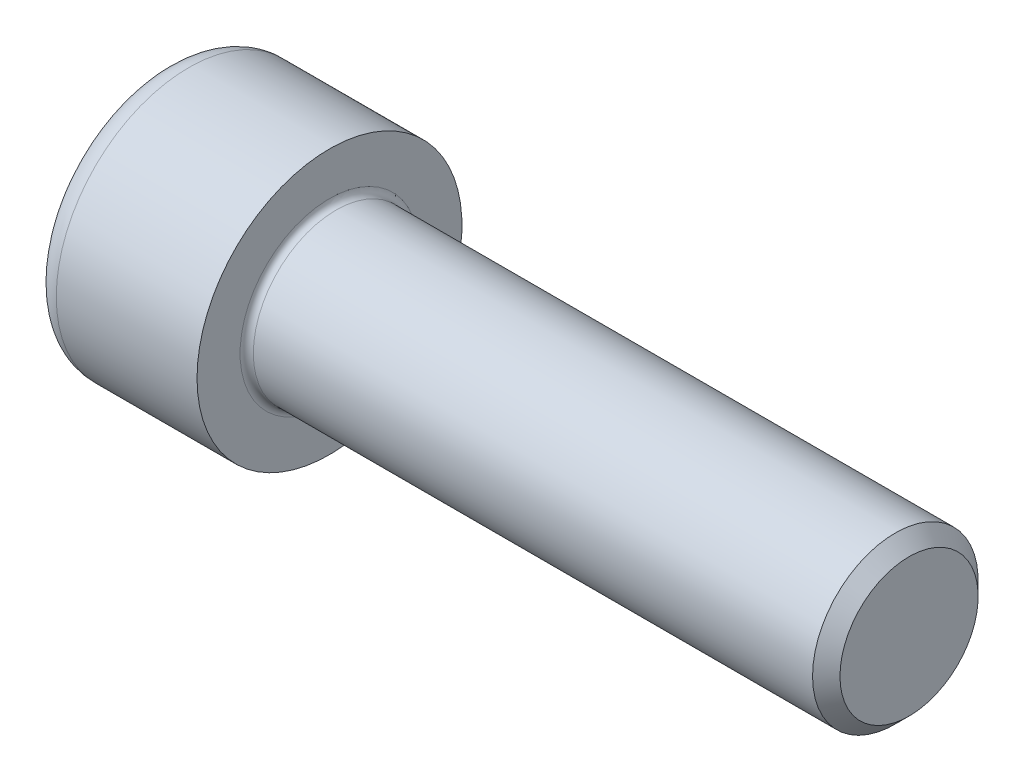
from build123d import *

# Parameters (mm, degrees)
FILLET1_R   = 0.4
FILLET2_R   = 1.5
HEX_2_DEPTH = 5


with BuildPart() as part:
    # BodySke → Base-Revolve (revolve)
    with BuildSketch(Plane.XY, mode=Mode.PRIVATE) as base_revolve_sk:
        Polygon((0, 0), (0, 8), (10, 8), (10, 5), (44.172, 5), (45, 4.172), (45, 0), align=None)
    revolve(base_revolve_sk.sketch.rotate(Axis((-31.75, 0, 0), (1, 0, 0)), 90), axis=Axis((-31.75, 0, 0), (1, 0, 0)))

    # Fillet1
    fillet1_edges = [part.edges().sort_by_distance(p)[0] for p in [
        (10, 0, -5),
    ]]
    fillet(fillet1_edges, radius=FILLET1_R)

    # Fillet2
    fillet2_edges = [part.edges().sort_by_distance(p)[0] for p in [
        (0, 0, -8),
    ]]
    fillet(fillet2_edges, radius=FILLET2_R)

    # Sketch2 → Hex-PreBroach (revolve, cut)
    with BuildSketch(Plane.XY, mode=Mode.PRIVATE) as hex_prebroach_sk:
        Polygon((0, 4.0575), (5, 4.0575), (7.342598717, 0), (0, 0), align=None)
    revolve(hex_prebroach_sk.sketch.rotate(Axis((0, 0, 0), (1, 0, 0)), 270), axis=Axis((0, 0, 0), (1, 0, 0)), mode=Mode.SUBTRACT)

    # Sketch3 → Hex 2 (cut)
    with BuildSketch(Plane(origin=(0, 0, 0), x_dir=(0, 0.500000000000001, 0.866025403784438), z_dir=(-1, 0, 0))):
        Polygon((2.342598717, 4.0575), (-2.342598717, 4.0575), (-4.685197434, 0), (-2.342598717, -4.0575), (2.342598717, -4.0575), (4.685197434, 0), align=None)
    extrude(amount=-HEX_2_DEPTH, mode=Mode.SUBTRACT)


solid = part.part
